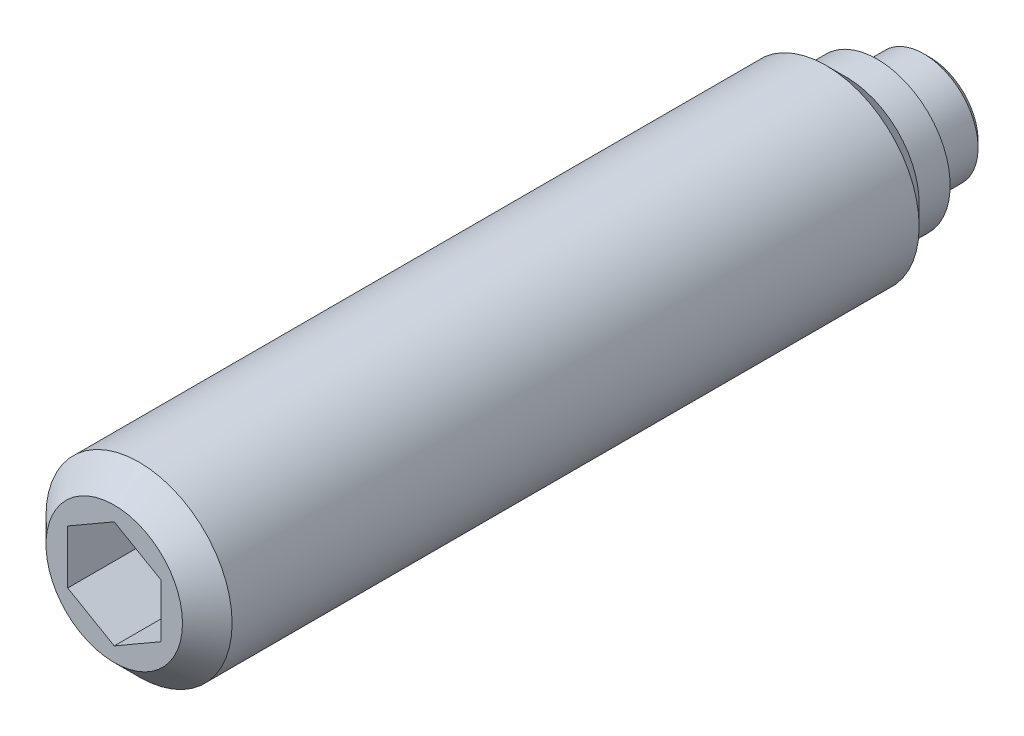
ISO-10303-21;
HEADER;
FILE_DESCRIPTION(('STEP AP214'),'2;1');
FILE_NAME('part.step','',(''),(''),'','','');
FILE_SCHEMA(('AUTOMOTIVE_DESIGN { 1 0 10303 214 1 1 1 1 }'));
ENDSEC;
DATA;
#1=APPLICATION_CONTEXT('core data for automotive mechanical design processes');
#2=APPLICATION_PROTOCOL_DEFINITION('international standard','automotive_design',2000,#1);
#3=PRODUCT_CONTEXT('',#1,'mechanical');
#4=PRODUCT('Part','Part','',(#3));
#5=PRODUCT_RELATED_PRODUCT_CATEGORY('part','',(#4));
#6=PRODUCT_DEFINITION_FORMATION('','',#4);
#7=PRODUCT_DEFINITION_CONTEXT('part definition',#1,'design');
#8=PRODUCT_DEFINITION('design','',#6,#7);
#9=PRODUCT_DEFINITION_SHAPE('','',#8);
#10=(LENGTH_UNIT() NAMED_UNIT(*) SI_UNIT(.MILLI.,.METRE.));
#11=(NAMED_UNIT(*) PLANE_ANGLE_UNIT() SI_UNIT($,.RADIAN.));
#12=(NAMED_UNIT(*) SI_UNIT($,.STERADIAN.) SOLID_ANGLE_UNIT());
#13=UNCERTAINTY_MEASURE_WITH_UNIT(LENGTH_MEASURE(1.E-05),#10,'distance_accuracy_value','');
#14=(GEOMETRIC_REPRESENTATION_CONTEXT(3) GLOBAL_UNCERTAINTY_ASSIGNED_CONTEXT((#13)) GLOBAL_UNIT_ASSIGNED_CONTEXT((#10,
#11,#12)) REPRESENTATION_CONTEXT('',''));
#15=CARTESIAN_POINT('',(0.,0.,0.));
#16=DIRECTION('',(0.,0.,1.));
#17=DIRECTION('',(1.,0.,0.));
#18=AXIS2_PLACEMENT_3D('',#15,#16,#17);
#19=CARTESIAN_POINT('',(0.,0.,0.));
#20=DIRECTION('',(0.,0.,-1.));
#21=DIRECTION('',(-1.,0.,0.));
#22=AXIS2_PLACEMENT_3D('',#19,#20,#21);
#23=CYLINDRICAL_SURFACE('',#22,1.75);
#24=CARTESIAN_POINT('',(0.,0.,0.2));
#25=DIRECTION('',(0.,0.,-1.));
#26=DIRECTION('',(-1.,0.,0.));
#27=AXIS2_PLACEMENT_3D('',#24,#25,#26);
#28=CIRCLE('',#27,1.75);
#29=CARTESIAN_POINT('',(-1.75,0.,0.2));
#30=VERTEX_POINT('',#29);
#31=EDGE_CURVE('E133',#30,#30,#28,.T.);
#32=ORIENTED_EDGE('',*,*,#31,.F.);
#33=EDGE_LOOP('',(#32));
#34=FACE_BOUND('',#33,.T.);
#35=CARTESIAN_POINT('',(0.,0.,1.7));
#36=DIRECTION('',(0.,0.,-1.));
#37=DIRECTION('',(-1.,0.,0.));
#38=AXIS2_PLACEMENT_3D('',#35,#36,#37);
#39=CIRCLE('',#38,1.75);
#40=CARTESIAN_POINT('',(-1.75,0.,1.7));
#41=VERTEX_POINT('',#40);
#42=EDGE_CURVE('E127',#41,#41,#39,.T.);
#43=ORIENTED_EDGE('',*,*,#42,.T.);
#44=EDGE_LOOP('',(#43));
#45=FACE_BOUND('',#44,.T.);
#46=ADVANCED_FACE('F14',(#34,#45),#23,.T.);
#47=CARTESIAN_POINT('',(0.,0.,0.2));
#48=DIRECTION('',(0.,0.,1.));
#49=DIRECTION('',(1.,0.,0.));
#50=AXIS2_PLACEMENT_3D('',#47,#48,#49);
#51=CONICAL_SURFACE('',#50,1.75,0.785398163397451);
#52=CARTESIAN_POINT('',(0.,0.,0.));
#53=DIRECTION('',(0.,0.,-1.));
#54=DIRECTION('',(-1.,0.,0.));
#55=AXIS2_PLACEMENT_3D('',#52,#53,#54);
#56=CIRCLE('',#55,1.55);
#57=CARTESIAN_POINT('',(-1.55,0.,0.));
#58=VERTEX_POINT('',#57);
#59=EDGE_CURVE('E130',#58,#58,#56,.T.);
#60=ORIENTED_EDGE('',*,*,#59,.F.);
#61=EDGE_LOOP('',(#60));
#62=FACE_BOUND('',#61,.T.);
#63=ORIENTED_EDGE('',*,*,#31,.T.);
#64=EDGE_LOOP('',(#63));
#65=FACE_BOUND('',#64,.T.);
#66=ADVANCED_FACE('F159',(#62,#65),#51,.T.);
#67=CARTESIAN_POINT('',(0.,1.55,0.));
#68=DIRECTION('',(0.,0.,1.));
#69=DIRECTION('',(1.,0.,0.));
#70=AXIS2_PLACEMENT_3D('',#67,#68,#69);
#71=PLANE('',#70);
#72=ORIENTED_EDGE('',*,*,#59,.T.);
#73=EDGE_LOOP('',(#72));
#74=FACE_BOUND('',#73,.T.);
#75=ADVANCED_FACE('F165',(#74),#71,.F.);
#76=CARTESIAN_POINT('',(0.,0.,1.7));
#77=DIRECTION('',(0.,0.,-1.));
#78=DIRECTION('',(-1.,0.,0.));
#79=AXIS2_PLACEMENT_3D('',#76,#77,#78);
#80=CYLINDRICAL_SURFACE('',#79,3.);
#81=CARTESIAN_POINT('',(0.,0.,3.35));
#82=DIRECTION('',(0.,0.,-1.));
#83=DIRECTION('',(-1.,0.,0.));
#84=AXIS2_PLACEMENT_3D('',#81,#82,#83);
#85=CIRCLE('',#84,3.);
#86=CARTESIAN_POINT('',(-3.,0.,3.35));
#87=VERTEX_POINT('',#86);
#88=EDGE_CURVE('E9',#87,#87,#85,.T.);
#89=ORIENTED_EDGE('',*,*,#88,.F.);
#90=EDGE_LOOP('',(#89));
#91=FACE_BOUND('',#90,.T.);
#92=CARTESIAN_POINT('',(0.,0.,25.5));
#93=DIRECTION('',(0.,0.,1.));
#94=DIRECTION('',(1.,0.,0.));
#95=AXIS2_PLACEMENT_3D('',#92,#93,#94);
#96=CIRCLE('',#95,3.);
#97=CARTESIAN_POINT('',(3.,0.,25.5));
#98=VERTEX_POINT('',#97);
#99=EDGE_CURVE('E124',#98,#98,#96,.T.);
#100=ORIENTED_EDGE('',*,*,#99,.F.);
#101=EDGE_LOOP('',(#100));
#102=FACE_BOUND('',#101,.T.);
#103=ADVANCED_FACE('F16',(#91,#102),#80,.T.);
#104=CARTESIAN_POINT('',(0.,2.35,1.7));
#105=DIRECTION('',(0.,0.,1.));
#106=DIRECTION('',(1.,0.,0.));
#107=AXIS2_PLACEMENT_3D('',#104,#105,#106);
#108=PLANE('',#107);
#109=CARTESIAN_POINT('',(0.,0.,1.7));
#110=DIRECTION('',(0.,0.,-1.));
#111=DIRECTION('',(-1.,0.,0.));
#112=AXIS2_PLACEMENT_3D('',#109,#110,#111);
#113=CIRCLE('',#112,2.35);
#114=CARTESIAN_POINT('',(-2.35,0.,1.7));
#115=VERTEX_POINT('',#114);
#116=EDGE_CURVE('E136',#115,#115,#113,.T.);
#117=ORIENTED_EDGE('',*,*,#116,.T.);
#118=EDGE_LOOP('',(#117));
#119=FACE_BOUND('',#118,.T.);
#120=ORIENTED_EDGE('',*,*,#42,.F.);
#121=EDGE_LOOP('',(#120));
#122=FACE_BOUND('',#121,.T.);
#123=ADVANCED_FACE('F156',(#119,#122),#108,.F.);
#124=CARTESIAN_POINT('',(0.,0.,1.7));
#125=DIRECTION('',(0.,0.,-1.));
#126=DIRECTION('',(-1.,0.,0.));
#127=AXIS2_PLACEMENT_3D('',#124,#125,#126);
#128=CYLINDRICAL_SURFACE('',#127,2.35);
#129=CARTESIAN_POINT('',(0.,0.,2.7));
#130=DIRECTION('',(0.,0.,-1.));
#131=DIRECTION('',(-1.,0.,0.));
#132=AXIS2_PLACEMENT_3D('',#129,#130,#131);
#133=CIRCLE('',#132,2.35);
#134=CARTESIAN_POINT('',(-2.35,0.,2.7));
#135=VERTEX_POINT('',#134);
#136=EDGE_CURVE('E22',#135,#135,#133,.T.);
#137=ORIENTED_EDGE('',*,*,#136,.T.);
#138=EDGE_LOOP('',(#137));
#139=FACE_BOUND('',#138,.T.);
#140=ORIENTED_EDGE('',*,*,#116,.F.);
#141=EDGE_LOOP('',(#140));
#142=FACE_BOUND('',#141,.T.);
#143=ADVANCED_FACE('F141',(#139,#142),#128,.T.);
#144=CARTESIAN_POINT('',(0.,0.,3.35));
#145=DIRECTION('',(0.,0.,1.));
#146=DIRECTION('',(1.,0.,0.));
#147=AXIS2_PLACEMENT_3D('',#144,#145,#146);
#148=CONICAL_SURFACE('',#147,3.,0.785398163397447);
#149=ORIENTED_EDGE('',*,*,#88,.T.);
#150=EDGE_LOOP('',(#149));
#151=FACE_BOUND('',#150,.T.);
#152=ORIENTED_EDGE('',*,*,#136,.F.);
#153=EDGE_LOOP('',(#152));
#154=FACE_BOUND('',#153,.T.);
#155=ADVANCED_FACE('F144',(#151,#154),#148,.T.);
#156=CARTESIAN_POINT('',(0.,-2.2,26.3));
#157=DIRECTION('',(0.,0.,1.));
#158=DIRECTION('',(1.,0.,0.));
#159=AXIS2_PLACEMENT_3D('',#156,#157,#158);
#160=PLANE('',#159);
#161=DIRECTION('',(0.866025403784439,-0.5,0.));
#162=VECTOR('',#161,1.);
#163=CARTESIAN_POINT('',(-1.5,-0.866025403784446,26.3));
#164=LINE('',#163,#162);
#165=CARTESIAN_POINT('',(-1.5,-0.866025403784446,26.3));
#166=VERTEX_POINT('',#165);
#167=CARTESIAN_POINT('',(0.,-1.73205080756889,26.3));
#168=VERTEX_POINT('',#167);
#169=EDGE_CURVE('E29',#166,#168,#164,.T.);
#170=ORIENTED_EDGE('',*,*,#169,.F.);
#171=DIRECTION('',(0.,-1.,0.));
#172=VECTOR('',#171,1.);
#173=CARTESIAN_POINT('',(-1.5,0.866025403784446,26.3));
#174=LINE('',#173,#172);
#175=CARTESIAN_POINT('',(-1.5,0.866025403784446,26.3));
#176=VERTEX_POINT('',#175);
#177=EDGE_CURVE('E112',#176,#166,#174,.T.);
#178=ORIENTED_EDGE('',*,*,#177,.F.);
#179=DIRECTION('',(-0.866025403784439,-0.5,0.));
#180=VECTOR('',#179,1.);
#181=CARTESIAN_POINT('',(0.,1.73205080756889,26.3));
#182=LINE('',#181,#180);
#183=CARTESIAN_POINT('',(0.,1.73205080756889,26.3));
#184=VERTEX_POINT('',#183);
#185=EDGE_CURVE('E110',#184,#176,#182,.T.);
#186=ORIENTED_EDGE('',*,*,#185,.F.);
#187=DIRECTION('',(-0.866025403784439,0.5,0.));
#188=VECTOR('',#187,1.);
#189=CARTESIAN_POINT('',(1.5,0.866025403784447,26.3));
#190=LINE('',#189,#188);
#191=CARTESIAN_POINT('',(1.5,0.866025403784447,26.3));
#192=VERTEX_POINT('',#191);
#193=EDGE_CURVE('E77',#192,#184,#190,.T.);
#194=ORIENTED_EDGE('',*,*,#193,.F.);
#195=DIRECTION('',(0.,1.,0.));
#196=VECTOR('',#195,1.);
#197=CARTESIAN_POINT('',(1.5,-0.866025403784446,26.3));
#198=LINE('',#197,#196);
#199=CARTESIAN_POINT('',(1.5,-0.866025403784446,26.3));
#200=VERTEX_POINT('',#199);
#201=EDGE_CURVE('E106',#200,#192,#198,.T.);
#202=ORIENTED_EDGE('',*,*,#201,.F.);
#203=DIRECTION('',(0.866025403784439,0.5,0.));
#204=VECTOR('',#203,1.);
#205=CARTESIAN_POINT('',(0.,-1.73205080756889,26.3));
#206=LINE('',#205,#204);
#207=EDGE_CURVE('E103',#168,#200,#206,.T.);
#208=ORIENTED_EDGE('',*,*,#207,.F.);
#209=EDGE_LOOP('',(#170,#178,#186,#194,#202,#208));
#210=FACE_BOUND('',#209,.T.);
#211=CARTESIAN_POINT('',(0.,0.,26.3));
#212=DIRECTION('',(0.,0.,1.));
#213=DIRECTION('',(1.,0.,0.));
#214=AXIS2_PLACEMENT_3D('',#211,#212,#213);
#215=CIRCLE('',#214,2.2);
#216=CARTESIAN_POINT('',(2.2,0.,26.3));
#217=VERTEX_POINT('',#216);
#218=EDGE_CURVE('E116',#217,#217,#215,.T.);
#219=ORIENTED_EDGE('',*,*,#218,.T.);
#220=EDGE_LOOP('',(#219));
#221=FACE_BOUND('',#220,.T.);
#222=ADVANCED_FACE('F146',(#210,#221),#160,.T.);
#223=CARTESIAN_POINT('',(0.,0.,26.3));
#224=DIRECTION('',(0.,0.,-1.));
#225=DIRECTION('',(-1.,0.,0.));
#226=AXIS2_PLACEMENT_3D('',#223,#224,#225);
#227=CONICAL_SURFACE('',#226,2.2,0.785398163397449);
#228=ORIENTED_EDGE('',*,*,#99,.T.);
#229=EDGE_LOOP('',(#228));
#230=FACE_BOUND('',#229,.T.);
#231=ORIENTED_EDGE('',*,*,#218,.F.);
#232=EDGE_LOOP('',(#231));
#233=FACE_BOUND('',#232,.T.);
#234=ADVANCED_FACE('F153',(#230,#233),#227,.T.);
#235=CARTESIAN_POINT('',(-1.5,-0.866025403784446,22.8));
#236=DIRECTION('',(-0.5,-0.866025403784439,0.));
#237=DIRECTION('',(0.866025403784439,-0.5,0.));
#238=AXIS2_PLACEMENT_3D('',#235,#236,#237);
#239=PLANE('',#238);
#240=ORIENTED_EDGE('',*,*,#169,.T.);
#241=DIRECTION('',(0.,0.,1.));
#242=VECTOR('',#241,1.);
#243=CARTESIAN_POINT('',(0.,-1.73205080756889,22.8));
#244=LINE('',#243,#242);
#245=CARTESIAN_POINT('',(0.,-1.73205080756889,22.8));
#246=VERTEX_POINT('',#245);
#247=EDGE_CURVE('E59',#246,#168,#244,.T.);
#248=ORIENTED_EDGE('',*,*,#247,.F.);
#249=DIRECTION('',(0.866025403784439,-0.5,0.));
#250=VECTOR('',#249,1.);
#251=CARTESIAN_POINT('',(-1.5,-0.866025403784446,22.8));
#252=LINE('',#251,#250);
#253=CARTESIAN_POINT('',(-1.5,-0.866025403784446,22.8));
#254=VERTEX_POINT('',#253);
#255=EDGE_CURVE('E114',#254,#246,#252,.T.);
#256=ORIENTED_EDGE('',*,*,#255,.F.);
#257=DIRECTION('',(0.,0.,1.));
#258=VECTOR('',#257,1.);
#259=CARTESIAN_POINT('',(-1.5,-0.866025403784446,22.8));
#260=LINE('',#259,#258);
#261=EDGE_CURVE('E37',#254,#166,#260,.T.);
#262=ORIENTED_EDGE('',*,*,#261,.T.);
#263=EDGE_LOOP('',(#240,#248,#256,#262));
#264=FACE_BOUND('',#263,.T.);
#265=ADVANCED_FACE('F191',(#264),#239,.F.);
#266=CARTESIAN_POINT('',(-1.5,0.866025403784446,22.8));
#267=DIRECTION('',(-1.,0.,0.));
#268=DIRECTION('',(0.,0.,1.));
#269=AXIS2_PLACEMENT_3D('',#266,#267,#268);
#270=PLANE('',#269);
#271=ORIENTED_EDGE('',*,*,#177,.T.);
#272=ORIENTED_EDGE('',*,*,#261,.F.);
#273=DIRECTION('',(0.,-1.,0.));
#274=VECTOR('',#273,1.);
#275=CARTESIAN_POINT('',(-1.5,0.866025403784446,22.8));
#276=LINE('',#275,#274);
#277=CARTESIAN_POINT('',(-1.5,0.866025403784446,22.8));
#278=VERTEX_POINT('',#277);
#279=EDGE_CURVE('E89',#278,#254,#276,.T.);
#280=ORIENTED_EDGE('',*,*,#279,.F.);
#281=DIRECTION('',(0.,0.,1.));
#282=VECTOR('',#281,1.);
#283=CARTESIAN_POINT('',(-1.5,0.866025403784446,22.8));
#284=LINE('',#283,#282);
#285=EDGE_CURVE('E81',#278,#176,#284,.T.);
#286=ORIENTED_EDGE('',*,*,#285,.T.);
#287=EDGE_LOOP('',(#271,#272,#280,#286));
#288=FACE_BOUND('',#287,.T.);
#289=ADVANCED_FACE('F198',(#288),#270,.F.);
#290=CARTESIAN_POINT('',(0.,1.73205080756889,22.8));
#291=DIRECTION('',(-0.5,0.866025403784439,0.));
#292=DIRECTION('',(-0.866025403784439,-0.5,0.));
#293=AXIS2_PLACEMENT_3D('',#290,#291,#292);
#294=PLANE('',#293);
#295=ORIENTED_EDGE('',*,*,#185,.T.);
#296=ORIENTED_EDGE('',*,*,#285,.F.);
#297=DIRECTION('',(-0.866025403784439,-0.5,0.));
#298=VECTOR('',#297,1.);
#299=CARTESIAN_POINT('',(0.,1.73205080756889,22.8));
#300=LINE('',#299,#298);
#301=CARTESIAN_POINT('',(0.,1.73205080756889,22.8));
#302=VERTEX_POINT('',#301);
#303=EDGE_CURVE('E85',#302,#278,#300,.T.);
#304=ORIENTED_EDGE('',*,*,#303,.F.);
#305=DIRECTION('',(0.,0.,1.));
#306=VECTOR('',#305,1.);
#307=CARTESIAN_POINT('',(0.,1.73205080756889,22.8));
#308=LINE('',#307,#306);
#309=EDGE_CURVE('E70',#302,#184,#308,.T.);
#310=ORIENTED_EDGE('',*,*,#309,.T.);
#311=EDGE_LOOP('',(#295,#296,#304,#310));
#312=FACE_BOUND('',#311,.T.);
#313=ADVANCED_FACE('F86',(#312),#294,.F.);
#314=CARTESIAN_POINT('',(1.5,0.866025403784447,22.8));
#315=DIRECTION('',(0.5,0.866025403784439,0.));
#316=DIRECTION('',(-0.866025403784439,0.5,0.));
#317=AXIS2_PLACEMENT_3D('',#314,#315,#316);
#318=PLANE('',#317);
#319=ORIENTED_EDGE('',*,*,#193,.T.);
#320=ORIENTED_EDGE('',*,*,#309,.F.);
#321=DIRECTION('',(-0.866025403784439,0.5,0.));
#322=VECTOR('',#321,1.);
#323=CARTESIAN_POINT('',(1.5,0.866025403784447,22.8));
#324=LINE('',#323,#322);
#325=CARTESIAN_POINT('',(1.5,0.866025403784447,22.8));
#326=VERTEX_POINT('',#325);
#327=EDGE_CURVE('E74',#326,#302,#324,.T.);
#328=ORIENTED_EDGE('',*,*,#327,.F.);
#329=DIRECTION('',(0.,0.,1.));
#330=VECTOR('',#329,1.);
#331=CARTESIAN_POINT('',(1.5,0.866025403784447,22.8));
#332=LINE('',#331,#330);
#333=EDGE_CURVE('E82',#326,#192,#332,.T.);
#334=ORIENTED_EDGE('',*,*,#333,.T.);
#335=EDGE_LOOP('',(#319,#320,#328,#334));
#336=FACE_BOUND('',#335,.T.);
#337=ADVANCED_FACE('F72',(#336),#318,.F.);
#338=CARTESIAN_POINT('',(1.5,-0.866025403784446,22.8));
#339=DIRECTION('',(1.,0.,0.));
#340=DIRECTION('',(0.,1.,0.));
#341=AXIS2_PLACEMENT_3D('',#338,#339,#340);
#342=PLANE('',#341);
#343=ORIENTED_EDGE('',*,*,#201,.T.);
#344=ORIENTED_EDGE('',*,*,#333,.F.);
#345=DIRECTION('',(0.,1.,0.));
#346=VECTOR('',#345,1.);
#347=CARTESIAN_POINT('',(1.5,-0.866025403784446,22.8));
#348=LINE('',#347,#346);
#349=CARTESIAN_POINT('',(1.5,-0.866025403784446,22.8));
#350=VERTEX_POINT('',#349);
#351=EDGE_CURVE('E95',#350,#326,#348,.T.);
#352=ORIENTED_EDGE('',*,*,#351,.F.);
#353=DIRECTION('',(0.,0.,1.));
#354=VECTOR('',#353,1.);
#355=CARTESIAN_POINT('',(1.5,-0.866025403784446,22.8));
#356=LINE('',#355,#354);
#357=EDGE_CURVE('E119',#350,#200,#356,.T.);
#358=ORIENTED_EDGE('',*,*,#357,.T.);
#359=EDGE_LOOP('',(#343,#344,#352,#358));
#360=FACE_BOUND('',#359,.T.);
#361=ADVANCED_FACE('F204',(#360),#342,.F.);
#362=CARTESIAN_POINT('',(0.,-1.73205080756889,22.8));
#363=DIRECTION('',(0.5,-0.866025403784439,0.));
#364=DIRECTION('',(0.866025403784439,0.5,0.));
#365=AXIS2_PLACEMENT_3D('',#362,#363,#364);
#366=PLANE('',#365);
#367=ORIENTED_EDGE('',*,*,#207,.T.);
#368=ORIENTED_EDGE('',*,*,#357,.F.);
#369=DIRECTION('',(0.866025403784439,0.5,0.));
#370=VECTOR('',#369,1.);
#371=CARTESIAN_POINT('',(0.,-1.73205080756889,22.8));
#372=LINE('',#371,#370);
#373=EDGE_CURVE('E97',#246,#350,#372,.T.);
#374=ORIENTED_EDGE('',*,*,#373,.F.);
#375=ORIENTED_EDGE('',*,*,#247,.T.);
#376=EDGE_LOOP('',(#367,#368,#374,#375));
#377=FACE_BOUND('',#376,.T.);
#378=ADVANCED_FACE('F201',(#377),#366,.F.);
#379=CARTESIAN_POINT('',(0.,0.,22.8));
#380=DIRECTION('',(0.,0.,1.));
#381=DIRECTION('',(1.,0.,0.));
#382=AXIS2_PLACEMENT_3D('',#379,#380,#381);
#383=PLANE('',#382);
#384=ORIENTED_EDGE('',*,*,#255,.T.);
#385=ORIENTED_EDGE('',*,*,#373,.T.);
#386=ORIENTED_EDGE('',*,*,#351,.T.);
#387=ORIENTED_EDGE('',*,*,#327,.T.);
#388=ORIENTED_EDGE('',*,*,#303,.T.);
#389=ORIENTED_EDGE('',*,*,#279,.T.);
#390=EDGE_LOOP('',(#384,#385,#386,#387,#388,#389));
#391=FACE_BOUND('',#390,.T.);
#392=ADVANCED_FACE('F92',(#391),#383,.T.);
#393=CLOSED_SHELL('',(#46,#66,#75,#103,#123,#143,#155,#222,#234,#265,#289,#313,#337,#361,#378,#392));
#394=MANIFOLD_SOLID_BREP('B1',#393);
#395=ADVANCED_BREP_SHAPE_REPRESENTATION('',(#18,#394),#14);
#396=SHAPE_DEFINITION_REPRESENTATION(#9,#395);
ENDSEC;
END-ISO-10303-21;
